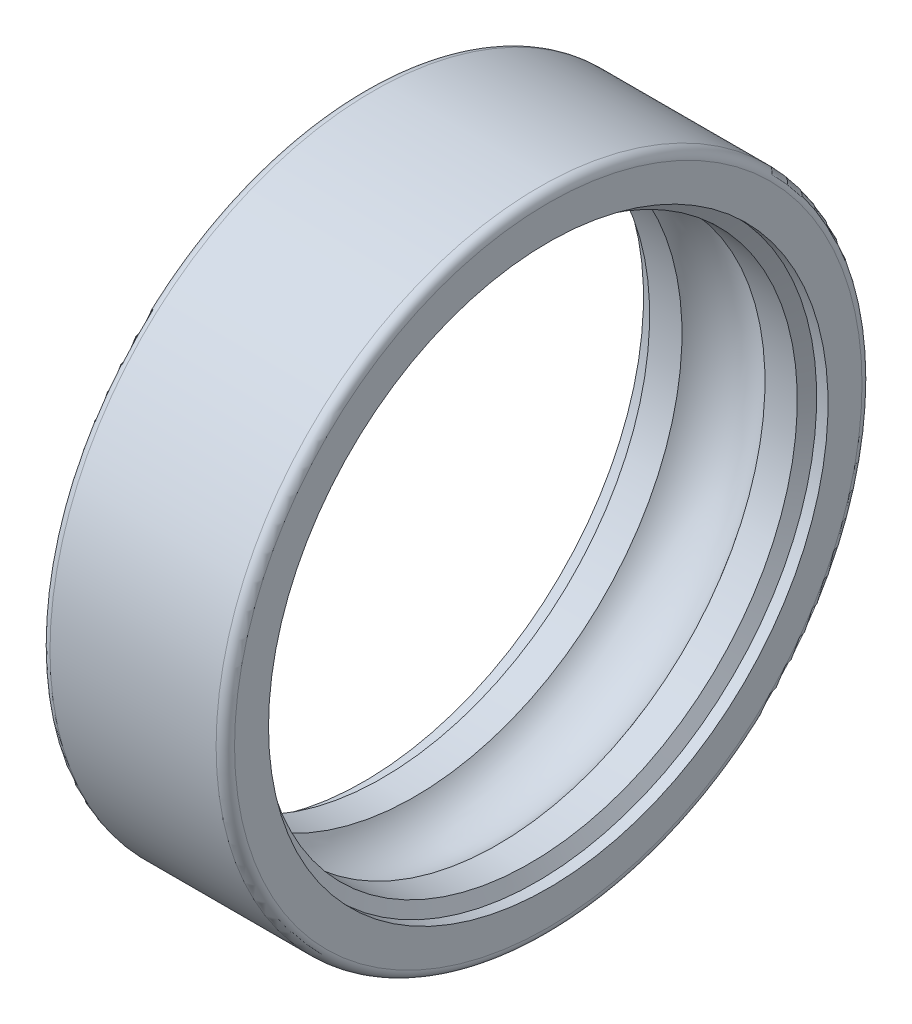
from build123d import *


with BuildPart() as part:
    # Esquisse1 → R_volution1 (revolve)
    with BuildSketch(Plane.XY, mode=Mode.PRIVATE) as r_volution1_sk:
        with BuildLine():
            Line((0, 17), (0, 15.16))
            Line((0, 15.16), (0.615484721, 15.16))
            Line((0.615484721, 15.16), (1, 14.494))
            Line((1, 14.494), (2.751008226, 14.494))
            ThreePointArc((2.751008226, 14.494), (5, 15.7), (7.248991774, 14.494))
            Line((7.248991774, 14.494), (9, 14.494))
            Line((9, 14.494), (9.384515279, 15.16))
            Line((9.384515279, 15.16), (10, 15.16))
            Line((10, 15.16), (10, 17))
            ThreePointArc((10, 17), (9.853553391, 17.353553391), (9.5, 17.5))
            Line((9.5, 17.5), (0.5, 17.5))
            ThreePointArc((0.5, 17.5), (0.146446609, 17.353553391), (0, 17))
        make_face()
    revolve(r_volution1_sk.sketch.rotate(Axis((10, 0, 0), (-1, 0, 0)), 270), axis=Axis((10, 0, 0), (-1, 0, 0)))


solid = part.part
